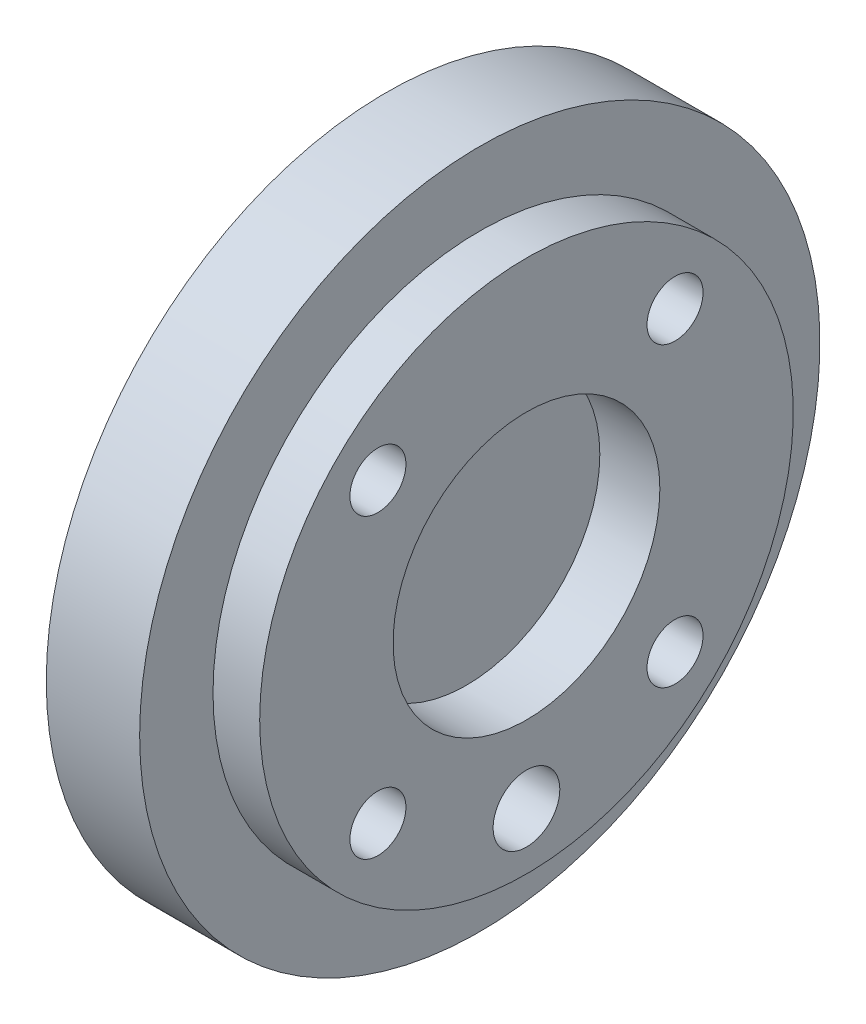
ISO-10303-21;
HEADER;
FILE_DESCRIPTION(('STEP AP214'),'2;1');
FILE_NAME('part.step','',(''),(''),'','','');
FILE_SCHEMA(('AUTOMOTIVE_DESIGN { 1 0 10303 214 1 1 1 1 }'));
ENDSEC;
DATA;
#1=APPLICATION_CONTEXT('core data for automotive mechanical design processes');
#2=APPLICATION_PROTOCOL_DEFINITION('international standard','automotive_design',2000,#1);
#3=PRODUCT_CONTEXT('',#1,'mechanical');
#4=PRODUCT('Part','Part','',(#3));
#5=PRODUCT_RELATED_PRODUCT_CATEGORY('part','',(#4));
#6=PRODUCT_DEFINITION_FORMATION('','',#4);
#7=PRODUCT_DEFINITION_CONTEXT('part definition',#1,'design');
#8=PRODUCT_DEFINITION('design','',#6,#7);
#9=PRODUCT_DEFINITION_SHAPE('','',#8);
#10=(LENGTH_UNIT() NAMED_UNIT(*) SI_UNIT(.MILLI.,.METRE.));
#11=(NAMED_UNIT(*) PLANE_ANGLE_UNIT() SI_UNIT($,.RADIAN.));
#12=(NAMED_UNIT(*) SI_UNIT($,.STERADIAN.) SOLID_ANGLE_UNIT());
#13=UNCERTAINTY_MEASURE_WITH_UNIT(LENGTH_MEASURE(1.E-05),#10,'distance_accuracy_value','');
#14=(GEOMETRIC_REPRESENTATION_CONTEXT(3) GLOBAL_UNCERTAINTY_ASSIGNED_CONTEXT((#13)) GLOBAL_UNIT_ASSIGNED_CONTEXT((#10,
#11,#12)) REPRESENTATION_CONTEXT('',''));
#15=CARTESIAN_POINT('',(0.,0.,0.));
#16=DIRECTION('',(0.,0.,1.));
#17=DIRECTION('',(1.,0.,0.));
#18=AXIS2_PLACEMENT_3D('',#15,#16,#17);
#19=CARTESIAN_POINT('',(75.5,0.,0.));
#20=DIRECTION('',(1.,0.,0.));
#21=DIRECTION('',(0.,0.,-1.));
#22=AXIS2_PLACEMENT_3D('',#19,#20,#21);
#23=PLANE('',#22);
#24=CARTESIAN_POINT('',(75.5,0.,0.));
#25=DIRECTION('',(1.,0.,0.));
#26=DIRECTION('',(0.,0.,-1.));
#27=AXIS2_PLACEMENT_3D('',#24,#25,#26);
#28=CIRCLE('',#27,10.);
#29=CARTESIAN_POINT('',(75.5,0.,-10.));
#30=VERTEX_POINT('',#29);
#31=EDGE_CURVE('E20',#30,#30,#28,.T.);
#32=ORIENTED_EDGE('',*,*,#31,.T.);
#33=EDGE_LOOP('',(#32));
#34=FACE_BOUND('',#33,.T.);
#35=ADVANCED_FACE('F17',(#34),#23,.T.);
#36=CARTESIAN_POINT('',(74.0000000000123,-15.75,0.));
#37=DIRECTION('',(1.,0.,0.));
#38=DIRECTION('',(0.,0.,-1.));
#39=AXIS2_PLACEMENT_3D('',#36,#37,#38);
#40=CONICAL_SURFACE('',#39,2.4999999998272,1.0297442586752);
#41=CARTESIAN_POINT('',(72.4978484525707,-15.75,5.6843418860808E-11));
#42=VERTEX_POINT('',#41);
#43=VERTEX_LOOP('',#42);
#44=FACE_BOUND('',#43,.T.);
#45=CARTESIAN_POINT('',(74.,-15.75,0.));
#46=DIRECTION('',(1.,0.,0.));
#47=DIRECTION('',(0.,0.,-1.));
#48=AXIS2_PLACEMENT_3D('',#45,#46,#47);
#49=CIRCLE('',#48,2.5);
#50=CARTESIAN_POINT('',(74.,-15.75,-2.5));
#51=VERTEX_POINT('',#50);
#52=EDGE_CURVE('E48',#51,#51,#49,.T.);
#53=ORIENTED_EDGE('',*,*,#52,.T.);
#54=EDGE_LOOP('',(#53));
#55=FACE_BOUND('',#54,.T.);
#56=ADVANCED_FACE('F42',(#44,#55),#40,.F.);
#57=CARTESIAN_POINT('',(71.5999999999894,-11.1369318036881,-11.1369318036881));
#58=DIRECTION('',(1.,0.,0.));
#59=DIRECTION('',(0.,0.,-1.));
#60=AXIS2_PLACEMENT_3D('',#57,#58,#59);
#61=CONICAL_SURFACE('',#60,2.09999999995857,1.02974425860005);
#62=CARTESIAN_POINT('',(70.3381926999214,-11.1369318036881,-11.1369318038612));
#63=VERTEX_POINT('',#62);
#64=VERTEX_LOOP('',#63);
#65=FACE_BOUND('',#64,.T.);
#66=CARTESIAN_POINT('',(71.6,-11.1369318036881,-11.1369318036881));
#67=DIRECTION('',(1.,0.,0.));
#68=DIRECTION('',(0.,0.,-1.));
#69=AXIS2_PLACEMENT_3D('',#66,#67,#68);
#70=CIRCLE('',#69,2.1);
#71=CARTESIAN_POINT('',(71.6,-11.1369318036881,-13.2369318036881));
#72=VERTEX_POINT('',#71);
#73=EDGE_CURVE('E50',#72,#72,#70,.T.);
#74=ORIENTED_EDGE('',*,*,#73,.T.);
#75=EDGE_LOOP('',(#74));
#76=FACE_BOUND('',#75,.T.);
#77=ADVANCED_FACE('F45',(#65,#76),#61,.F.);
#78=CARTESIAN_POINT('',(71.6000000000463,11.1369318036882,-11.1369318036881));
#79=DIRECTION('',(1.,0.,0.));
#80=DIRECTION('',(0.,0.,-1.));
#81=AXIS2_PLACEMENT_3D('',#78,#79,#80);
#82=CONICAL_SURFACE('',#81,2.10000000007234,1.02974425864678);
#83=CARTESIAN_POINT('',(70.3381927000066,11.1369318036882,-11.1369318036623));
#84=VERTEX_POINT('',#83);
#85=VERTEX_LOOP('',#84);
#86=FACE_BOUND('',#85,.T.);
#87=CARTESIAN_POINT('',(71.6,11.1369318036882,-11.1369318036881));
#88=DIRECTION('',(1.,0.,0.));
#89=DIRECTION('',(0.,0.,-1.));
#90=AXIS2_PLACEMENT_3D('',#87,#88,#89);
#91=CIRCLE('',#90,2.1);
#92=CARTESIAN_POINT('',(71.6,11.1369318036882,-13.2369318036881));
#93=VERTEX_POINT('',#92);
#94=EDGE_CURVE('E53',#93,#93,#91,.T.);
#95=ORIENTED_EDGE('',*,*,#94,.T.);
#96=EDGE_LOOP('',(#95));
#97=FACE_BOUND('',#96,.T.);
#98=ADVANCED_FACE('F95',(#86,#97),#82,.F.);
#99=CARTESIAN_POINT('',(71.5999999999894,11.1369318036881,11.1369318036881));
#100=DIRECTION('',(1.,0.,0.));
#101=DIRECTION('',(0.,0.,-1.));
#102=AXIS2_PLACEMENT_3D('',#99,#100,#101);
#103=CONICAL_SURFACE('',#102,2.10000000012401,1.02974425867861);
#104=CARTESIAN_POINT('',(70.3381926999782,11.1369318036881,11.1369318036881));
#105=VERTEX_POINT('',#104);
#106=VERTEX_LOOP('',#105);
#107=FACE_BOUND('',#106,.T.);
#108=CARTESIAN_POINT('',(71.6,11.1369318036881,11.1369318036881));
#109=DIRECTION('',(1.,0.,0.));
#110=DIRECTION('',(0.,0.,-1.));
#111=AXIS2_PLACEMENT_3D('',#108,#109,#110);
#112=CIRCLE('',#111,2.1);
#113=CARTESIAN_POINT('',(71.6,11.1369318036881,9.03693180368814));
#114=VERTEX_POINT('',#113);
#115=EDGE_CURVE('E86',#114,#114,#112,.T.);
#116=ORIENTED_EDGE('',*,*,#115,.T.);
#117=EDGE_LOOP('',(#116));
#118=FACE_BOUND('',#117,.T.);
#119=ADVANCED_FACE('F161',(#107,#118),#103,.F.);
#120=CARTESIAN_POINT('',(71.6000000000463,-11.1369318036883,11.136931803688));
#121=DIRECTION('',(1.,0.,0.));
#122=DIRECTION('',(0.,0.,-1.));
#123=AXIS2_PLACEMENT_3D('',#120,#121,#122);
#124=CONICAL_SURFACE('',#123,2.10000000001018,1.02974425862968);
#125=CARTESIAN_POINT('',(70.3381927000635,-11.1369318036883,11.1369318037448));
#126=VERTEX_POINT('',#125);
#127=VERTEX_LOOP('',#126);
#128=FACE_BOUND('',#127,.T.);
#129=CARTESIAN_POINT('',(71.6,-11.1369318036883,11.136931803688));
#130=DIRECTION('',(1.,0.,0.));
#131=DIRECTION('',(0.,0.,-1.));
#132=AXIS2_PLACEMENT_3D('',#129,#130,#131);
#133=CIRCLE('',#132,2.1);
#134=CARTESIAN_POINT('',(71.6,-11.1369318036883,9.036931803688));
#135=VERTEX_POINT('',#134);
#136=EDGE_CURVE('E82',#135,#135,#133,.T.);
#137=ORIENTED_EDGE('',*,*,#136,.T.);
#138=EDGE_LOOP('',(#137));
#139=FACE_BOUND('',#138,.T.);
#140=ADVANCED_FACE('F157',(#128,#139),#124,.F.);
#141=CARTESIAN_POINT('',(75.5,0.,0.));
#142=DIRECTION('',(1.,0.,0.));
#143=DIRECTION('',(0.,0.,-1.));
#144=AXIS2_PLACEMENT_3D('',#141,#142,#143);
#145=CYLINDRICAL_SURFACE('',#144,10.);
#146=ORIENTED_EDGE('',*,*,#31,.F.);
#147=EDGE_LOOP('',(#146));
#148=FACE_BOUND('',#147,.T.);
#149=CARTESIAN_POINT('',(80.,0.,0.));
#150=DIRECTION('',(1.,0.,0.));
#151=DIRECTION('',(0.,0.,-1.));
#152=AXIS2_PLACEMENT_3D('',#149,#150,#151);
#153=CIRCLE('',#152,10.);
#154=CARTESIAN_POINT('',(80.,0.,-10.));
#155=VERTEX_POINT('',#154);
#156=EDGE_CURVE('E80',#155,#155,#153,.F.);
#157=ORIENTED_EDGE('',*,*,#156,.F.);
#158=EDGE_LOOP('',(#157));
#159=FACE_BOUND('',#158,.T.);
#160=ADVANCED_FACE('F154',(#148,#159),#145,.F.);
#161=CARTESIAN_POINT('',(80.,-15.75,0.));
#162=DIRECTION('',(1.,0.,0.));
#163=DIRECTION('',(0.,0.,-1.));
#164=AXIS2_PLACEMENT_3D('',#161,#162,#163);
#165=CYLINDRICAL_SURFACE('',#164,2.5);
#166=ORIENTED_EDGE('',*,*,#52,.F.);
#167=EDGE_LOOP('',(#166));
#168=FACE_BOUND('',#167,.T.);
#169=CARTESIAN_POINT('',(80.,-15.75,0.));
#170=DIRECTION('',(1.,0.,0.));
#171=DIRECTION('',(0.,0.,-1.));
#172=AXIS2_PLACEMENT_3D('',#169,#170,#171);
#173=CIRCLE('',#172,2.5);
#174=CARTESIAN_POINT('',(80.,-15.75,-2.5));
#175=VERTEX_POINT('',#174);
#176=EDGE_CURVE('E78',#175,#175,#173,.F.);
#177=ORIENTED_EDGE('',*,*,#176,.F.);
#178=EDGE_LOOP('',(#177));
#179=FACE_BOUND('',#178,.T.);
#180=ADVANCED_FACE('F150',(#168,#179),#165,.F.);
#181=CARTESIAN_POINT('',(80.,-11.1369318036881,-11.1369318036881));
#182=DIRECTION('',(1.,0.,0.));
#183=DIRECTION('',(0.,0.,-1.));
#184=AXIS2_PLACEMENT_3D('',#181,#182,#183);
#185=CYLINDRICAL_SURFACE('',#184,2.1);
#186=ORIENTED_EDGE('',*,*,#73,.F.);
#187=EDGE_LOOP('',(#186));
#188=FACE_BOUND('',#187,.T.);
#189=CARTESIAN_POINT('',(80.,-11.1369318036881,-11.1369318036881));
#190=DIRECTION('',(1.,0.,0.));
#191=DIRECTION('',(0.,0.,-1.));
#192=AXIS2_PLACEMENT_3D('',#189,#190,#191);
#193=CIRCLE('',#192,2.1);
#194=CARTESIAN_POINT('',(80.,-11.1369318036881,-13.2369318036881));
#195=VERTEX_POINT('',#194);
#196=EDGE_CURVE('E75',#195,#195,#193,.F.);
#197=ORIENTED_EDGE('',*,*,#196,.F.);
#198=EDGE_LOOP('',(#197));
#199=FACE_BOUND('',#198,.T.);
#200=ADVANCED_FACE('F101',(#188,#199),#185,.F.);
#201=CARTESIAN_POINT('',(80.,11.1369318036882,-11.1369318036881));
#202=DIRECTION('',(1.,0.,0.));
#203=DIRECTION('',(0.,0.,-1.));
#204=AXIS2_PLACEMENT_3D('',#201,#202,#203);
#205=CYLINDRICAL_SURFACE('',#204,2.1);
#206=ORIENTED_EDGE('',*,*,#94,.F.);
#207=EDGE_LOOP('',(#206));
#208=FACE_BOUND('',#207,.T.);
#209=CARTESIAN_POINT('',(80.,11.1369318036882,-11.1369318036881));
#210=DIRECTION('',(1.,0.,0.));
#211=DIRECTION('',(0.,0.,-1.));
#212=AXIS2_PLACEMENT_3D('',#209,#210,#211);
#213=CIRCLE('',#212,2.1);
#214=CARTESIAN_POINT('',(80.,11.1369318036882,-13.2369318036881));
#215=VERTEX_POINT('',#214);
#216=EDGE_CURVE('E72',#215,#215,#213,.F.);
#217=ORIENTED_EDGE('',*,*,#216,.F.);
#218=EDGE_LOOP('',(#217));
#219=FACE_BOUND('',#218,.T.);
#220=ADVANCED_FACE('F97',(#208,#219),#205,.F.);
#221=CARTESIAN_POINT('',(80.,11.1369318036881,11.1369318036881));
#222=DIRECTION('',(1.,0.,0.));
#223=DIRECTION('',(0.,0.,-1.));
#224=AXIS2_PLACEMENT_3D('',#221,#222,#223);
#225=CYLINDRICAL_SURFACE('',#224,2.1);
#226=ORIENTED_EDGE('',*,*,#115,.F.);
#227=EDGE_LOOP('',(#226));
#228=FACE_BOUND('',#227,.T.);
#229=CARTESIAN_POINT('',(80.,11.1369318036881,11.1369318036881));
#230=DIRECTION('',(1.,0.,0.));
#231=DIRECTION('',(0.,0.,-1.));
#232=AXIS2_PLACEMENT_3D('',#229,#230,#231);
#233=CIRCLE('',#232,2.1);
#234=CARTESIAN_POINT('',(80.,11.1369318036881,9.03693180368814));
#235=VERTEX_POINT('',#234);
#236=EDGE_CURVE('E69',#235,#235,#233,.F.);
#237=ORIENTED_EDGE('',*,*,#236,.F.);
#238=EDGE_LOOP('',(#237));
#239=FACE_BOUND('',#238,.T.);
#240=ADVANCED_FACE('F100',(#228,#239),#225,.F.);
#241=CARTESIAN_POINT('',(80.,-11.1369318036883,11.136931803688));
#242=DIRECTION('',(1.,0.,0.));
#243=DIRECTION('',(0.,0.,-1.));
#244=AXIS2_PLACEMENT_3D('',#241,#242,#243);
#245=CYLINDRICAL_SURFACE('',#244,2.1);
#246=ORIENTED_EDGE('',*,*,#136,.F.);
#247=EDGE_LOOP('',(#246));
#248=FACE_BOUND('',#247,.T.);
#249=CARTESIAN_POINT('',(80.,-11.1369318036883,11.136931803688));
#250=DIRECTION('',(1.,0.,0.));
#251=DIRECTION('',(0.,0.,-1.));
#252=AXIS2_PLACEMENT_3D('',#249,#250,#251);
#253=CIRCLE('',#252,2.1);
#254=CARTESIAN_POINT('',(80.,-11.1369318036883,9.036931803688));
#255=VERTEX_POINT('',#254);
#256=EDGE_CURVE('E66',#255,#255,#253,.F.);
#257=ORIENTED_EDGE('',*,*,#256,.F.);
#258=EDGE_LOOP('',(#257));
#259=FACE_BOUND('',#258,.T.);
#260=ADVANCED_FACE('F109',(#248,#259),#245,.F.);
#261=CARTESIAN_POINT('',(80.,0.,0.));
#262=DIRECTION('',(1.,0.,0.));
#263=DIRECTION('',(0.,0.,-1.));
#264=AXIS2_PLACEMENT_3D('',#261,#262,#263);
#265=PLANE('',#264);
#266=ORIENTED_EDGE('',*,*,#256,.T.);
#267=EDGE_LOOP('',(#266));
#268=FACE_BOUND('',#267,.T.);
#269=ORIENTED_EDGE('',*,*,#236,.T.);
#270=EDGE_LOOP('',(#269));
#271=FACE_BOUND('',#270,.T.);
#272=ORIENTED_EDGE('',*,*,#216,.T.);
#273=EDGE_LOOP('',(#272));
#274=FACE_BOUND('',#273,.T.);
#275=ORIENTED_EDGE('',*,*,#196,.T.);
#276=EDGE_LOOP('',(#275));
#277=FACE_BOUND('',#276,.T.);
#278=ORIENTED_EDGE('',*,*,#176,.T.);
#279=EDGE_LOOP('',(#278));
#280=FACE_BOUND('',#279,.T.);
#281=ORIENTED_EDGE('',*,*,#156,.T.);
#282=EDGE_LOOP('',(#281));
#283=FACE_BOUND('',#282,.T.);
#284=CARTESIAN_POINT('',(80.,0.,0.));
#285=DIRECTION('',(-1.,0.,0.));
#286=DIRECTION('',(0.,0.,1.));
#287=AXIS2_PLACEMENT_3D('',#284,#285,#286);
#288=CIRCLE('',#287,20.);
#289=CARTESIAN_POINT('',(80.,0.,20.));
#290=VERTEX_POINT('',#289);
#291=EDGE_CURVE('E63',#290,#290,#288,.T.);
#292=ORIENTED_EDGE('',*,*,#291,.F.);
#293=EDGE_LOOP('',(#292));
#294=FACE_BOUND('',#293,.T.);
#295=ADVANCED_FACE('F105',(#268,#271,#274,#277,#280,#283,#294),#265,.T.);
#296=CARTESIAN_POINT('',(80.,0.,0.));
#297=DIRECTION('',(-1.,0.,0.));
#298=DIRECTION('',(0.,0.,1.));
#299=AXIS2_PLACEMENT_3D('',#296,#297,#298);
#300=CYLINDRICAL_SURFACE('',#299,20.);
#301=ORIENTED_EDGE('',*,*,#291,.T.);
#302=EDGE_LOOP('',(#301));
#303=FACE_BOUND('',#302,.T.);
#304=CARTESIAN_POINT('',(76.5,0.,0.));
#305=DIRECTION('',(-1.,0.,0.));
#306=DIRECTION('',(0.,0.,1.));
#307=AXIS2_PLACEMENT_3D('',#304,#305,#306);
#308=CIRCLE('',#307,20.);
#309=CARTESIAN_POINT('',(76.5,0.,20.));
#310=VERTEX_POINT('',#309);
#311=EDGE_CURVE('E60',#310,#310,#308,.T.);
#312=ORIENTED_EDGE('',*,*,#311,.F.);
#313=EDGE_LOOP('',(#312));
#314=FACE_BOUND('',#313,.T.);
#315=ADVANCED_FACE('F108',(#303,#314),#300,.T.);
#316=CARTESIAN_POINT('',(76.5,0.,0.));
#317=DIRECTION('',(1.,0.,0.));
#318=DIRECTION('',(0.,0.,-1.));
#319=AXIS2_PLACEMENT_3D('',#316,#317,#318);
#320=PLANE('',#319);
#321=ORIENTED_EDGE('',*,*,#311,.T.);
#322=EDGE_LOOP('',(#321));
#323=FACE_BOUND('',#322,.T.);
#324=CARTESIAN_POINT('',(76.5,0.,0.));
#325=DIRECTION('',(-1.,0.,0.));
#326=DIRECTION('',(0.,0.,1.));
#327=AXIS2_PLACEMENT_3D('',#324,#325,#326);
#328=CIRCLE('',#327,25.5);
#329=CARTESIAN_POINT('',(76.5,0.,25.5));
#330=VERTEX_POINT('',#329);
#331=EDGE_CURVE('E26',#330,#330,#328,.T.);
#332=ORIENTED_EDGE('',*,*,#331,.F.);
#333=EDGE_LOOP('',(#332));
#334=FACE_BOUND('',#333,.T.);
#335=ADVANCED_FACE('F120',(#323,#334),#320,.T.);
#336=CARTESIAN_POINT('',(76.5,0.,0.));
#337=DIRECTION('',(-1.,0.,0.));
#338=DIRECTION('',(0.,0.,1.));
#339=AXIS2_PLACEMENT_3D('',#336,#337,#338);
#340=CYLINDRICAL_SURFACE('',#339,25.5);
#341=ORIENTED_EDGE('',*,*,#331,.T.);
#342=EDGE_LOOP('',(#341));
#343=FACE_BOUND('',#342,.T.);
#344=CARTESIAN_POINT('',(69.5,0.,0.));
#345=DIRECTION('',(-1.,0.,0.));
#346=DIRECTION('',(0.,0.,1.));
#347=AXIS2_PLACEMENT_3D('',#344,#345,#346);
#348=CIRCLE('',#347,25.5);
#349=CARTESIAN_POINT('',(69.5,0.,25.5));
#350=VERTEX_POINT('',#349);
#351=EDGE_CURVE('E11',#350,#350,#348,.F.);
#352=ORIENTED_EDGE('',*,*,#351,.T.);
#353=EDGE_LOOP('',(#352));
#354=FACE_BOUND('',#353,.T.);
#355=ADVANCED_FACE('F126',(#343,#354),#340,.T.);
#356=CARTESIAN_POINT('',(69.5,0.,0.));
#357=DIRECTION('',(1.,0.,0.));
#358=DIRECTION('',(0.,0.,-1.));
#359=AXIS2_PLACEMENT_3D('',#356,#357,#358);
#360=PLANE('',#359);
#361=ORIENTED_EDGE('',*,*,#351,.F.);
#362=EDGE_LOOP('',(#361));
#363=FACE_BOUND('',#362,.T.);
#364=ADVANCED_FACE('F132',(#363),#360,.F.);
#365=CLOSED_SHELL('',(#35,#56,#77,#98,#119,#140,#160,#180,#200,#220,#240,#260,#295,#315,#335,
#355,#364));
#366=MANIFOLD_SOLID_BREP('B1',#365);
#367=ADVANCED_BREP_SHAPE_REPRESENTATION('',(#18,#366),#14);
#368=SHAPE_DEFINITION_REPRESENTATION(#9,#367);
ENDSEC;
END-ISO-10303-21;
